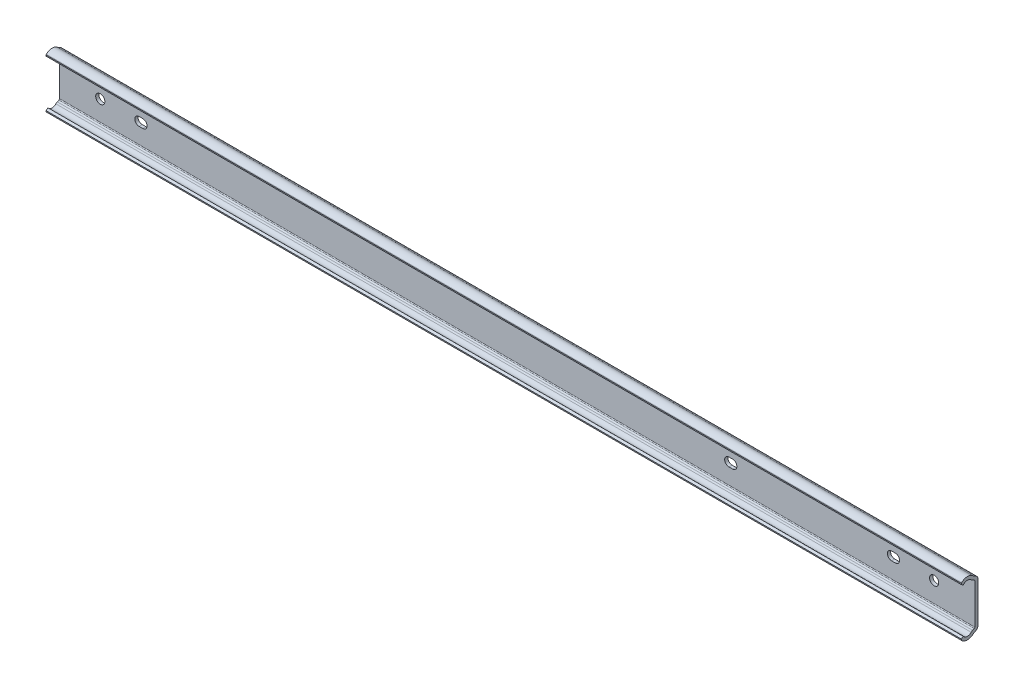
ISO-10303-21;
HEADER;
FILE_DESCRIPTION(('STEP AP214'),'2;1');
FILE_NAME('part.step','',(''),(''),'','','');
FILE_SCHEMA(('AUTOMOTIVE_DESIGN { 1 0 10303 214 1 1 1 1 }'));
ENDSEC;
DATA;
#1=APPLICATION_CONTEXT('core data for automotive mechanical design processes');
#2=APPLICATION_PROTOCOL_DEFINITION('international standard','automotive_design',2000,#1);
#3=PRODUCT_CONTEXT('',#1,'mechanical');
#4=PRODUCT('Part','Part','',(#3));
#5=PRODUCT_RELATED_PRODUCT_CATEGORY('part','',(#4));
#6=PRODUCT_DEFINITION_FORMATION('','',#4);
#7=PRODUCT_DEFINITION_CONTEXT('part definition',#1,'design');
#8=PRODUCT_DEFINITION('design','',#6,#7);
#9=PRODUCT_DEFINITION_SHAPE('','',#8);
#10=(LENGTH_UNIT() NAMED_UNIT(*) SI_UNIT(.MILLI.,.METRE.));
#11=(NAMED_UNIT(*) PLANE_ANGLE_UNIT() SI_UNIT($,.RADIAN.));
#12=(NAMED_UNIT(*) SI_UNIT($,.STERADIAN.) SOLID_ANGLE_UNIT());
#13=UNCERTAINTY_MEASURE_WITH_UNIT(LENGTH_MEASURE(1.E-05),#10,'distance_accuracy_value','');
#14=(GEOMETRIC_REPRESENTATION_CONTEXT(3) GLOBAL_UNCERTAINTY_ASSIGNED_CONTEXT((#13)) GLOBAL_UNIT_ASSIGNED_CONTEXT((#10,
#11,#12)) REPRESENTATION_CONTEXT('',''));
#15=CARTESIAN_POINT('',(0.,0.,0.));
#16=DIRECTION('',(0.,0.,1.));
#17=DIRECTION('',(1.,0.,0.));
#18=AXIS2_PLACEMENT_3D('',#15,#16,#17);
#19=CARTESIAN_POINT('',(-20.,9.85313395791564,1.54999999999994));
#20=DIRECTION('',(0.,0.,1.));
#21=DIRECTION('',(-1.,0.,0.));
#22=AXIS2_PLACEMENT_3D('',#19,#20,#21);
#23=PLANE('',#22);
#24=DIRECTION('',(0.,-1.,0.));
#25=VECTOR('',#24,1.);
#26=CARTESIAN_POINT('',(-20.,9.85313395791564,1.54999999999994));
#27=LINE('',#26,#25);
#28=CARTESIAN_POINT('',(-20.,9.85313395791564,1.54999999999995));
#29=VERTEX_POINT('',#28);
#30=CARTESIAN_POINT('',(-20.,-9.85313395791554,1.54999999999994));
#31=VERTEX_POINT('',#30);
#32=EDGE_CURVE('E510',#29,#31,#27,.T.);
#33=ORIENTED_EDGE('',*,*,#32,.T.);
#34=DIRECTION('',(1.,0.,0.));
#35=VECTOR('',#34,1.);
#36=CARTESIAN_POINT('',(-20.,-9.85313395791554,1.54999999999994));
#37=LINE('',#36,#35);
#38=CARTESIAN_POINT('',(430.,-9.85313395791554,1.54999999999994));
#39=VERTEX_POINT('',#38);
#40=EDGE_CURVE('E524',#31,#39,#37,.T.);
#41=ORIENTED_EDGE('',*,*,#40,.T.);
#42=DIRECTION('',(0.,-1.,0.));
#43=VECTOR('',#42,1.);
#44=CARTESIAN_POINT('',(430.,9.85313395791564,1.54999999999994));
#45=LINE('',#44,#43);
#46=CARTESIAN_POINT('',(430.,9.85313395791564,1.54999999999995));
#47=VERTEX_POINT('',#46);
#48=EDGE_CURVE('E435',#47,#39,#45,.T.);
#49=ORIENTED_EDGE('',*,*,#48,.F.);
#50=DIRECTION('',(1.,0.,0.));
#51=VECTOR('',#50,1.);
#52=CARTESIAN_POINT('',(-20.,9.85313395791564,1.54999999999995));
#53=LINE('',#52,#51);
#54=EDGE_CURVE('E526',#29,#47,#53,.T.);
#55=ORIENTED_EDGE('',*,*,#54,.F.);
#56=EDGE_LOOP('',(#33,#41,#49,#55));
#57=FACE_BOUND('',#56,.T.);
#58=CARTESIAN_POINT('',(20.9,0.,1.54999999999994));
#59=DIRECTION('',(0.,0.,1.));
#60=DIRECTION('',(-1.,0.,0.));
#61=AXIS2_PLACEMENT_3D('',#58,#59,#60);
#62=CIRCLE('',#61,2.1);
#63=CARTESIAN_POINT('',(20.9,-2.1,1.54999999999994));
#64=VERTEX_POINT('',#63);
#65=CARTESIAN_POINT('',(20.9,2.1,1.54999999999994));
#66=VERTEX_POINT('',#65);
#67=EDGE_CURVE('E31',#64,#66,#62,.T.);
#68=ORIENTED_EDGE('',*,*,#67,.F.);
#69=DIRECTION('',(1.,0.,0.));
#70=VECTOR('',#69,1.);
#71=CARTESIAN_POINT('',(20.9,-2.1,1.54999999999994));
#72=LINE('',#71,#70);
#73=CARTESIAN_POINT('',(19.1,-2.1,1.54999999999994));
#74=VERTEX_POINT('',#73);
#75=EDGE_CURVE('E277',#74,#64,#72,.T.);
#76=ORIENTED_EDGE('',*,*,#75,.F.);
#77=CARTESIAN_POINT('',(19.1,0.,1.54999999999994));
#78=DIRECTION('',(0.,0.,1.));
#79=DIRECTION('',(-1.,0.,0.));
#80=AXIS2_PLACEMENT_3D('',#77,#78,#79);
#81=CIRCLE('',#80,2.1);
#82=CARTESIAN_POINT('',(19.1,2.1,1.54999999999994));
#83=VERTEX_POINT('',#82);
#84=EDGE_CURVE('E262',#83,#74,#81,.T.);
#85=ORIENTED_EDGE('',*,*,#84,.F.);
#86=DIRECTION('',(-1.,0.,0.));
#87=VECTOR('',#86,1.);
#88=CARTESIAN_POINT('',(20.9,2.1,1.54999999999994));
#89=LINE('',#88,#87);
#90=EDGE_CURVE('E271',#66,#83,#89,.T.);
#91=ORIENTED_EDGE('',*,*,#90,.F.);
#92=EDGE_LOOP('',(#68,#76,#85,#91));
#93=FACE_BOUND('',#92,.T.);
#94=CARTESIAN_POINT('',(310.9,0.,1.54999999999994));
#95=DIRECTION('',(0.,0.,1.));
#96=DIRECTION('',(-1.,0.,0.));
#97=AXIS2_PLACEMENT_3D('',#94,#95,#96);
#98=CIRCLE('',#97,2.1);
#99=CARTESIAN_POINT('',(310.9,-2.09999999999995,1.54999999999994));
#100=VERTEX_POINT('',#99);
#101=CARTESIAN_POINT('',(310.9,2.10000000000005,1.54999999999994));
#102=VERTEX_POINT('',#101);
#103=EDGE_CURVE('E293',#100,#102,#98,.T.);
#104=ORIENTED_EDGE('',*,*,#103,.F.);
#105=DIRECTION('',(1.,0.,0.));
#106=VECTOR('',#105,1.);
#107=CARTESIAN_POINT('',(310.9,-2.09999999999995,1.54999999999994));
#108=LINE('',#107,#106);
#109=CARTESIAN_POINT('',(309.1,-2.09999999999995,1.54999999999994));
#110=VERTEX_POINT('',#109);
#111=EDGE_CURVE('E303',#110,#100,#108,.T.);
#112=ORIENTED_EDGE('',*,*,#111,.F.);
#113=CARTESIAN_POINT('',(309.1,0.,1.54999999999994));
#114=DIRECTION('',(0.,0.,1.));
#115=DIRECTION('',(-1.,0.,0.));
#116=AXIS2_PLACEMENT_3D('',#113,#114,#115);
#117=CIRCLE('',#116,2.1);
#118=CARTESIAN_POINT('',(309.1,2.10000000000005,1.54999999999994));
#119=VERTEX_POINT('',#118);
#120=EDGE_CURVE('E300',#119,#110,#117,.T.);
#121=ORIENTED_EDGE('',*,*,#120,.F.);
#122=DIRECTION('',(-1.,0.,0.));
#123=VECTOR('',#122,1.);
#124=CARTESIAN_POINT('',(310.9,2.10000000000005,1.54999999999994));
#125=LINE('',#124,#123);
#126=EDGE_CURVE('E297',#102,#119,#125,.T.);
#127=ORIENTED_EDGE('',*,*,#126,.F.);
#128=EDGE_LOOP('',(#104,#112,#121,#127));
#129=FACE_BOUND('',#128,.T.);
#130=CARTESIAN_POINT('',(410.,0.,1.54999999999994));
#131=DIRECTION('',(0.,0.,1.));
#132=DIRECTION('',(-1.,0.,0.));
#133=AXIS2_PLACEMENT_3D('',#130,#131,#132);
#134=CIRCLE('',#133,2.24999999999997);
#135=CARTESIAN_POINT('',(407.75,0.,1.54999999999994));
#136=VERTEX_POINT('',#135);
#137=EDGE_CURVE('E321',#136,#136,#134,.T.);
#138=ORIENTED_EDGE('',*,*,#137,.F.);
#139=EDGE_LOOP('',(#138));
#140=FACE_BOUND('',#139,.T.);
#141=CARTESIAN_POINT('',(0.,0.,1.54999999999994));
#142=DIRECTION('',(0.,0.,1.));
#143=DIRECTION('',(-1.,0.,0.));
#144=AXIS2_PLACEMENT_3D('',#141,#142,#143);
#145=CIRCLE('',#144,2.24999999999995);
#146=CARTESIAN_POINT('',(-2.24999999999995,0.,1.54999999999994));
#147=VERTEX_POINT('',#146);
#148=EDGE_CURVE('E333',#147,#147,#145,.T.);
#149=ORIENTED_EDGE('',*,*,#148,.F.);
#150=EDGE_LOOP('',(#149));
#151=FACE_BOUND('',#150,.T.);
#152=CARTESIAN_POINT('',(389.1,0.,1.54999999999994));
#153=DIRECTION('',(0.,0.,1.));
#154=DIRECTION('',(-1.,0.,0.));
#155=AXIS2_PLACEMENT_3D('',#152,#153,#154);
#156=CIRCLE('',#155,2.1);
#157=CARTESIAN_POINT('',(389.1,2.10000000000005,1.54999999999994));
#158=VERTEX_POINT('',#157);
#159=CARTESIAN_POINT('',(389.1,-2.09999999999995,1.54999999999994));
#160=VERTEX_POINT('',#159);
#161=EDGE_CURVE('E339',#158,#160,#156,.T.);
#162=ORIENTED_EDGE('',*,*,#161,.F.);
#163=DIRECTION('',(-1.,0.,0.));
#164=VECTOR('',#163,1.);
#165=CARTESIAN_POINT('',(390.9,2.10000000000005,1.54999999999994));
#166=LINE('',#165,#164);
#167=CARTESIAN_POINT('',(390.9,2.10000000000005,1.54999999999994));
#168=VERTEX_POINT('',#167);
#169=EDGE_CURVE('E347',#168,#158,#166,.T.);
#170=ORIENTED_EDGE('',*,*,#169,.F.);
#171=CARTESIAN_POINT('',(390.9,0.,1.54999999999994));
#172=DIRECTION('',(0.,0.,1.));
#173=DIRECTION('',(-1.,0.,0.));
#174=AXIS2_PLACEMENT_3D('',#171,#172,#173);
#175=CIRCLE('',#174,2.1);
#176=CARTESIAN_POINT('',(390.9,-2.09999999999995,1.54999999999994));
#177=VERTEX_POINT('',#176);
#178=EDGE_CURVE('E344',#177,#168,#175,.T.);
#179=ORIENTED_EDGE('',*,*,#178,.F.);
#180=DIRECTION('',(1.,0.,0.));
#181=VECTOR('',#180,1.);
#182=CARTESIAN_POINT('',(390.9,-2.09999999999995,1.54999999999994));
#183=LINE('',#182,#181);
#184=EDGE_CURVE('E341',#160,#177,#183,.T.);
#185=ORIENTED_EDGE('',*,*,#184,.F.);
#186=EDGE_LOOP('',(#162,#170,#179,#185));
#187=FACE_BOUND('',#186,.T.);
#188=ADVANCED_FACE('F14',(#57,#93,#129,#140,#151,#187),#23,.T.);
#189=CARTESIAN_POINT('',(-20.,9.85313395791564,0.));
#190=DIRECTION('',(0.,0.,-1.));
#191=DIRECTION('',(1.,0.,0.));
#192=AXIS2_PLACEMENT_3D('',#189,#190,#191);
#193=PLANE('',#192);
#194=DIRECTION('',(0.,1.,0.));
#195=VECTOR('',#194,1.);
#196=CARTESIAN_POINT('',(-20.,9.85313395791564,0.));
#197=LINE('',#196,#195);
#198=CARTESIAN_POINT('',(-20.,-9.85313395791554,0.));
#199=VERTEX_POINT('',#198);
#200=CARTESIAN_POINT('',(-20.,9.85313395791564,0.));
#201=VERTEX_POINT('',#200);
#202=EDGE_CURVE('E473',#199,#201,#197,.T.);
#203=ORIENTED_EDGE('',*,*,#202,.T.);
#204=DIRECTION('',(1.,0.,0.));
#205=VECTOR('',#204,1.);
#206=CARTESIAN_POINT('',(-20.,9.85313395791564,0.));
#207=LINE('',#206,#205);
#208=CARTESIAN_POINT('',(430.,9.85313395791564,0.));
#209=VERTEX_POINT('',#208);
#210=EDGE_CURVE('E551',#201,#209,#207,.T.);
#211=ORIENTED_EDGE('',*,*,#210,.T.);
#212=DIRECTION('',(0.,1.,0.));
#213=VECTOR('',#212,1.);
#214=CARTESIAN_POINT('',(430.,9.85313395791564,0.));
#215=LINE('',#214,#213);
#216=CARTESIAN_POINT('',(430.,-9.85313395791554,0.));
#217=VERTEX_POINT('',#216);
#218=EDGE_CURVE('E397',#217,#209,#215,.T.);
#219=ORIENTED_EDGE('',*,*,#218,.F.);
#220=DIRECTION('',(1.,0.,0.));
#221=VECTOR('',#220,1.);
#222=CARTESIAN_POINT('',(-20.,-9.85313395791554,0.));
#223=LINE('',#222,#221);
#224=EDGE_CURVE('E553',#199,#217,#223,.T.);
#225=ORIENTED_EDGE('',*,*,#224,.F.);
#226=EDGE_LOOP('',(#203,#211,#219,#225));
#227=FACE_BOUND('',#226,.T.);
#228=CARTESIAN_POINT('',(20.9,0.,0.));
#229=DIRECTION('',(0.,0.,1.));
#230=DIRECTION('',(-1.,0.,0.));
#231=AXIS2_PLACEMENT_3D('',#228,#229,#230);
#232=CIRCLE('',#231,2.1);
#233=CARTESIAN_POINT('',(20.9,-2.1,0.));
#234=VERTEX_POINT('',#233);
#235=CARTESIAN_POINT('',(20.9,2.1,0.));
#236=VERTEX_POINT('',#235);
#237=EDGE_CURVE('E279',#234,#236,#232,.T.);
#238=ORIENTED_EDGE('',*,*,#237,.T.);
#239=DIRECTION('',(-1.,0.,0.));
#240=VECTOR('',#239,1.);
#241=CARTESIAN_POINT('',(20.9,2.1,0.));
#242=LINE('',#241,#240);
#243=CARTESIAN_POINT('',(19.1,2.1,0.));
#244=VERTEX_POINT('',#243);
#245=EDGE_CURVE('E285',#236,#244,#242,.T.);
#246=ORIENTED_EDGE('',*,*,#245,.T.);
#247=CARTESIAN_POINT('',(19.1,0.,0.));
#248=DIRECTION('',(0.,0.,1.));
#249=DIRECTION('',(-1.,0.,0.));
#250=AXIS2_PLACEMENT_3D('',#247,#248,#249);
#251=CIRCLE('',#250,2.1);
#252=CARTESIAN_POINT('',(19.1,-2.1,0.));
#253=VERTEX_POINT('',#252);
#254=EDGE_CURVE('E39',#244,#253,#251,.T.);
#255=ORIENTED_EDGE('',*,*,#254,.T.);
#256=DIRECTION('',(1.,0.,0.));
#257=VECTOR('',#256,1.);
#258=CARTESIAN_POINT('',(20.9,-2.1,0.));
#259=LINE('',#258,#257);
#260=EDGE_CURVE('E288',#253,#234,#259,.T.);
#261=ORIENTED_EDGE('',*,*,#260,.T.);
#262=EDGE_LOOP('',(#238,#246,#255,#261));
#263=FACE_BOUND('',#262,.T.);
#264=CARTESIAN_POINT('',(310.9,0.,0.));
#265=DIRECTION('',(0.,0.,1.));
#266=DIRECTION('',(-1.,0.,0.));
#267=AXIS2_PLACEMENT_3D('',#264,#265,#266);
#268=CIRCLE('',#267,2.1);
#269=CARTESIAN_POINT('',(310.9,-2.09999999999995,0.));
#270=VERTEX_POINT('',#269);
#271=CARTESIAN_POINT('',(310.9,2.10000000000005,0.));
#272=VERTEX_POINT('',#271);
#273=EDGE_CURVE('E306',#270,#272,#268,.T.);
#274=ORIENTED_EDGE('',*,*,#273,.T.);
#275=DIRECTION('',(-1.,0.,0.));
#276=VECTOR('',#275,1.);
#277=CARTESIAN_POINT('',(310.9,2.10000000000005,0.));
#278=LINE('',#277,#276);
#279=CARTESIAN_POINT('',(309.1,2.10000000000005,0.));
#280=VERTEX_POINT('',#279);
#281=EDGE_CURVE('E309',#272,#280,#278,.T.);
#282=ORIENTED_EDGE('',*,*,#281,.T.);
#283=CARTESIAN_POINT('',(309.1,0.,0.));
#284=DIRECTION('',(0.,0.,1.));
#285=DIRECTION('',(-1.,0.,0.));
#286=AXIS2_PLACEMENT_3D('',#283,#284,#285);
#287=CIRCLE('',#286,2.1);
#288=CARTESIAN_POINT('',(309.1,-2.09999999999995,0.));
#289=VERTEX_POINT('',#288);
#290=EDGE_CURVE('E312',#280,#289,#287,.T.);
#291=ORIENTED_EDGE('',*,*,#290,.T.);
#292=DIRECTION('',(1.,0.,0.));
#293=VECTOR('',#292,1.);
#294=CARTESIAN_POINT('',(310.9,-2.09999999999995,0.));
#295=LINE('',#294,#293);
#296=EDGE_CURVE('E315',#289,#270,#295,.T.);
#297=ORIENTED_EDGE('',*,*,#296,.T.);
#298=EDGE_LOOP('',(#274,#282,#291,#297));
#299=FACE_BOUND('',#298,.T.);
#300=CARTESIAN_POINT('',(410.,0.,0.));
#301=DIRECTION('',(0.,0.,1.));
#302=DIRECTION('',(-1.,0.,0.));
#303=AXIS2_PLACEMENT_3D('',#300,#301,#302);
#304=CIRCLE('',#303,2.24999999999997);
#305=CARTESIAN_POINT('',(407.75,0.,0.));
#306=VERTEX_POINT('',#305);
#307=EDGE_CURVE('E330',#306,#306,#304,.T.);
#308=ORIENTED_EDGE('',*,*,#307,.T.);
#309=EDGE_LOOP('',(#308));
#310=FACE_BOUND('',#309,.T.);
#311=CARTESIAN_POINT('',(0.,0.,0.));
#312=DIRECTION('',(0.,0.,1.));
#313=DIRECTION('',(-1.,0.,0.));
#314=AXIS2_PLACEMENT_3D('',#311,#312,#313);
#315=CIRCLE('',#314,2.24999999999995);
#316=CARTESIAN_POINT('',(-2.24999999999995,0.,0.));
#317=VERTEX_POINT('',#316);
#318=EDGE_CURVE('E336',#317,#317,#315,.T.);
#319=ORIENTED_EDGE('',*,*,#318,.T.);
#320=EDGE_LOOP('',(#319));
#321=FACE_BOUND('',#320,.T.);
#322=CARTESIAN_POINT('',(389.1,0.,0.));
#323=DIRECTION('',(0.,0.,1.));
#324=DIRECTION('',(-1.,0.,0.));
#325=AXIS2_PLACEMENT_3D('',#322,#323,#324);
#326=CIRCLE('',#325,2.1);
#327=CARTESIAN_POINT('',(389.1,2.10000000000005,0.));
#328=VERTEX_POINT('',#327);
#329=CARTESIAN_POINT('',(389.1,-2.09999999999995,0.));
#330=VERTEX_POINT('',#329);
#331=EDGE_CURVE('E350',#328,#330,#326,.T.);
#332=ORIENTED_EDGE('',*,*,#331,.T.);
#333=DIRECTION('',(1.,0.,0.));
#334=VECTOR('',#333,1.);
#335=CARTESIAN_POINT('',(390.9,-2.09999999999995,0.));
#336=LINE('',#335,#334);
#337=CARTESIAN_POINT('',(390.9,-2.09999999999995,0.));
#338=VERTEX_POINT('',#337);
#339=EDGE_CURVE('E353',#330,#338,#336,.T.);
#340=ORIENTED_EDGE('',*,*,#339,.T.);
#341=CARTESIAN_POINT('',(390.9,0.,0.));
#342=DIRECTION('',(0.,0.,1.));
#343=DIRECTION('',(-1.,0.,0.));
#344=AXIS2_PLACEMENT_3D('',#341,#342,#343);
#345=CIRCLE('',#344,2.1);
#346=CARTESIAN_POINT('',(390.9,2.10000000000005,0.));
#347=VERTEX_POINT('',#346);
#348=EDGE_CURVE('E356',#338,#347,#345,.T.);
#349=ORIENTED_EDGE('',*,*,#348,.T.);
#350=DIRECTION('',(-1.,0.,0.));
#351=VECTOR('',#350,1.);
#352=CARTESIAN_POINT('',(390.9,2.10000000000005,0.));
#353=LINE('',#352,#351);
#354=EDGE_CURVE('E359',#347,#328,#353,.T.);
#355=ORIENTED_EDGE('',*,*,#354,.T.);
#356=EDGE_LOOP('',(#332,#340,#349,#355));
#357=FACE_BOUND('',#356,.T.);
#358=ADVANCED_FACE('F618',(#227,#263,#299,#310,#321,#357),#193,.T.);
#359=CARTESIAN_POINT('',(-20.,-9.46999976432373,5.19000022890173));
#360=DIRECTION('',(1.,0.,0.));
#361=DIRECTION('',(0.,0.,1.));
#362=AXIS2_PLACEMENT_3D('',#359,#360,#361);
#363=CYLINDRICAL_SURFACE('',#362,2.47999999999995);
#364=CARTESIAN_POINT('',(430.,-9.46999976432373,5.19000022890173));
#365=DIRECTION('',(-1.,0.,0.));
#366=DIRECTION('',(0.,0.,1.));
#367=AXIS2_PLACEMENT_3D('',#364,#365,#366);
#368=CIRCLE('',#367,2.47999999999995);
#369=CARTESIAN_POINT('',(430.,-11.1527317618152,3.3682392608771));
#370=VERTEX_POINT('',#369);
#371=CARTESIAN_POINT('',(430.,-11.2236245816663,6.94362504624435));
#372=VERTEX_POINT('',#371);
#373=EDGE_CURVE('E365',#370,#372,#368,.T.);
#374=ORIENTED_EDGE('',*,*,#373,.F.);
#375=DIRECTION('',(1.,0.,0.));
#376=VECTOR('',#375,1.);
#377=CARTESIAN_POINT('',(-20.,-11.1527317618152,3.3682392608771));
#378=LINE('',#377,#376);
#379=CARTESIAN_POINT('',(-20.,-11.1527317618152,3.3682392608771));
#380=VERTEX_POINT('',#379);
#381=EDGE_CURVE('E9',#380,#370,#378,.T.);
#382=ORIENTED_EDGE('',*,*,#381,.F.);
#383=CARTESIAN_POINT('',(-20.,-9.46999976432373,5.19000022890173));
#384=DIRECTION('',(-1.,0.,0.));
#385=DIRECTION('',(0.,0.,1.));
#386=AXIS2_PLACEMENT_3D('',#383,#384,#385);
#387=CIRCLE('',#386,2.47999999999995);
#388=CARTESIAN_POINT('',(-20.,-11.2236245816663,6.94362504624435));
#389=VERTEX_POINT('',#388);
#390=EDGE_CURVE('E447',#380,#389,#387,.T.);
#391=ORIENTED_EDGE('',*,*,#390,.T.);
#392=DIRECTION('',(1.,0.,0.));
#393=VECTOR('',#392,1.);
#394=CARTESIAN_POINT('',(-20.,-11.2236245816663,6.94362504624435));
#395=LINE('',#394,#393);
#396=EDGE_CURVE('E18',#389,#372,#395,.T.);
#397=ORIENTED_EDGE('',*,*,#396,.T.);
#398=EDGE_LOOP('',(#374,#382,#391,#397));
#399=FACE_BOUND('',#398,.T.);
#400=ADVANCED_FACE('F16',(#399),#363,.F.);
#401=CARTESIAN_POINT('',(-20.,-12.5436997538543,1.86234824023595));
#402=DIRECTION('',(1.,0.,0.));
#403=DIRECTION('',(0.,0.,1.));
#404=AXIS2_PLACEMENT_3D('',#401,#402,#403);
#405=CYLINDRICAL_SURFACE('',#404,2.04999993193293);
#406=CARTESIAN_POINT('',(430.,-12.5436997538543,1.86234824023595));
#407=DIRECTION('',(1.,0.,0.));
#408=DIRECTION('',(0.,0.,1.));
#409=AXIS2_PLACEMENT_3D('',#406,#407,#408);
#410=CIRCLE('',#409,2.04999993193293);
#411=CARTESIAN_POINT('',(430.,-10.6566648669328,2.66334702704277));
#412=VERTEX_POINT('',#411);
#413=EDGE_CURVE('E444',#412,#370,#410,.T.);
#414=ORIENTED_EDGE('',*,*,#413,.F.);
#415=DIRECTION('',(1.,0.,0.));
#416=VECTOR('',#415,1.);
#417=CARTESIAN_POINT('',(-20.,-10.6566648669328,2.66334702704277));
#418=LINE('',#417,#416);
#419=CARTESIAN_POINT('',(-20.,-10.6566648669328,2.66334702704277));
#420=VERTEX_POINT('',#419);
#421=EDGE_CURVE('E23',#420,#412,#418,.T.);
#422=ORIENTED_EDGE('',*,*,#421,.F.);
#423=CARTESIAN_POINT('',(-20.,-12.5436997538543,1.86234824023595));
#424=DIRECTION('',(1.,0.,0.));
#425=DIRECTION('',(0.,0.,1.));
#426=AXIS2_PLACEMENT_3D('',#423,#424,#425);
#427=CIRCLE('',#426,2.04999993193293);
#428=EDGE_CURVE('E518',#420,#380,#427,.T.);
#429=ORIENTED_EDGE('',*,*,#428,.T.);
#430=ORIENTED_EDGE('',*,*,#381,.T.);
#431=EDGE_LOOP('',(#414,#422,#429,#430));
#432=FACE_BOUND('',#431,.T.);
#433=ADVANCED_FACE('F581',(#432),#405,.T.);
#434=CARTESIAN_POINT('',(-20.,-10.6566648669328,2.66334702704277));
#435=DIRECTION('',(0.,0.920504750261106,0.390731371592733));
#436=DIRECTION('',(0.,-0.390731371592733,0.920504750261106));
#437=AXIS2_PLACEMENT_3D('',#434,#435,#436);
#438=PLANE('',#437);
#439=DIRECTION('',(0.,-0.390731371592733,0.920504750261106));
#440=VECTOR('',#439,1.);
#441=CARTESIAN_POINT('',(430.,-10.6566648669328,2.66334702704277));
#442=LINE('',#441,#440);
#443=CARTESIAN_POINT('',(430.,-10.3133868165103,1.85463521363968));
#444=VERTEX_POINT('',#443);
#445=EDGE_CURVE('E441',#444,#412,#442,.T.);
#446=ORIENTED_EDGE('',*,*,#445,.F.);
#447=DIRECTION('',(1.,0.,0.));
#448=VECTOR('',#447,1.);
#449=CARTESIAN_POINT('',(-20.,-10.3133868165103,1.85463521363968));
#450=LINE('',#449,#448);
#451=CARTESIAN_POINT('',(-20.,-10.3133868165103,1.85463521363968));
#452=VERTEX_POINT('',#451);
#453=EDGE_CURVE('E522',#452,#444,#450,.T.);
#454=ORIENTED_EDGE('',*,*,#453,.F.);
#455=DIRECTION('',(0.,-0.390731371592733,0.920504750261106));
#456=VECTOR('',#455,1.);
#457=CARTESIAN_POINT('',(-20.,-10.6566648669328,2.66334702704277));
#458=LINE('',#457,#456);
#459=EDGE_CURVE('E515',#452,#420,#458,.T.);
#460=ORIENTED_EDGE('',*,*,#459,.T.);
#461=ORIENTED_EDGE('',*,*,#421,.T.);
#462=EDGE_LOOP('',(#446,#454,#460,#461));
#463=FACE_BOUND('',#462,.T.);
#464=ADVANCED_FACE('F678',(#463),#438,.T.);
#465=CARTESIAN_POINT('',(-20.,-9.85313395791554,2.05000015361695));
#466=DIRECTION('',(1.,0.,0.));
#467=DIRECTION('',(0.,0.,1.));
#468=AXIS2_PLACEMENT_3D('',#465,#466,#467);
#469=CYLINDRICAL_SURFACE('',#468,0.500000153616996);
#470=CARTESIAN_POINT('',(430.,-9.85313395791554,2.05000015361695));
#471=DIRECTION('',(-1.,0.,0.));
#472=DIRECTION('',(0.,0.,1.));
#473=AXIS2_PLACEMENT_3D('',#470,#471,#472);
#474=CIRCLE('',#473,0.500000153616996);
#475=EDGE_CURVE('E438',#39,#444,#474,.T.);
#476=ORIENTED_EDGE('',*,*,#475,.F.);
#477=ORIENTED_EDGE('',*,*,#40,.F.);
#478=CARTESIAN_POINT('',(-20.,-9.85313395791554,2.05000015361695));
#479=DIRECTION('',(-1.,0.,0.));
#480=DIRECTION('',(0.,0.,1.));
#481=AXIS2_PLACEMENT_3D('',#478,#479,#480);
#482=CIRCLE('',#481,0.500000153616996);
#483=EDGE_CURVE('E512',#31,#452,#482,.T.);
#484=ORIENTED_EDGE('',*,*,#483,.T.);
#485=ORIENTED_EDGE('',*,*,#453,.T.);
#486=EDGE_LOOP('',(#476,#477,#484,#485));
#487=FACE_BOUND('',#486,.T.);
#488=ADVANCED_FACE('F676',(#487),#469,.F.);
#489=CARTESIAN_POINT('',(-20.,9.85313395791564,2.05000015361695));
#490=DIRECTION('',(1.,0.,0.));
#491=DIRECTION('',(0.,0.,1.));
#492=AXIS2_PLACEMENT_3D('',#489,#490,#491);
#493=CYLINDRICAL_SURFACE('',#492,0.500000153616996);
#494=CARTESIAN_POINT('',(430.,9.85313395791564,2.05000015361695));
#495=DIRECTION('',(-1.,0.,0.));
#496=DIRECTION('',(0.,0.,-1.));
#497=AXIS2_PLACEMENT_3D('',#494,#495,#496);
#498=CIRCLE('',#497,0.500000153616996);
#499=CARTESIAN_POINT('',(430.,10.3133868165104,1.85463521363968));
#500=VERTEX_POINT('',#499);
#501=EDGE_CURVE('E432',#500,#47,#498,.T.);
#502=ORIENTED_EDGE('',*,*,#501,.F.);
#503=DIRECTION('',(1.,0.,0.));
#504=VECTOR('',#503,1.);
#505=CARTESIAN_POINT('',(-20.,10.3133868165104,1.85463521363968));
#506=LINE('',#505,#504);
#507=CARTESIAN_POINT('',(-20.,10.3133868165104,1.85463521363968));
#508=VERTEX_POINT('',#507);
#509=EDGE_CURVE('E528',#508,#500,#506,.T.);
#510=ORIENTED_EDGE('',*,*,#509,.F.);
#511=CARTESIAN_POINT('',(-20.,9.85313395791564,2.05000015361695));
#512=DIRECTION('',(-1.,0.,0.));
#513=DIRECTION('',(0.,0.,-1.));
#514=AXIS2_PLACEMENT_3D('',#511,#512,#513);
#515=CIRCLE('',#514,0.500000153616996);
#516=EDGE_CURVE('E507',#508,#29,#515,.T.);
#517=ORIENTED_EDGE('',*,*,#516,.T.);
#518=ORIENTED_EDGE('',*,*,#54,.T.);
#519=EDGE_LOOP('',(#502,#510,#517,#518));
#520=FACE_BOUND('',#519,.T.);
#521=ADVANCED_FACE('F668',(#520),#493,.F.);
#522=CARTESIAN_POINT('',(-20.,10.6566648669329,2.66334702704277));
#523=DIRECTION('',(0.,-0.920504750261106,0.390731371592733));
#524=DIRECTION('',(0.,-0.390731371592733,-0.920504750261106));
#525=AXIS2_PLACEMENT_3D('',#522,#523,#524);
#526=PLANE('',#525);
#527=DIRECTION('',(0.,-0.390731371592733,-0.920504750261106));
#528=VECTOR('',#527,1.);
#529=CARTESIAN_POINT('',(430.,10.6566648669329,2.66334702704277));
#530=LINE('',#529,#528);
#531=CARTESIAN_POINT('',(430.,10.6566648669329,2.66334702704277));
#532=VERTEX_POINT('',#531);
#533=EDGE_CURVE('E429',#532,#500,#530,.T.);
#534=ORIENTED_EDGE('',*,*,#533,.F.);
#535=DIRECTION('',(1.,0.,0.));
#536=VECTOR('',#535,1.);
#537=CARTESIAN_POINT('',(-20.,10.6566648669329,2.66334702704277));
#538=LINE('',#537,#536);
#539=CARTESIAN_POINT('',(-20.,10.6566648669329,2.66334702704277));
#540=VERTEX_POINT('',#539);
#541=EDGE_CURVE('E530',#540,#532,#538,.T.);
#542=ORIENTED_EDGE('',*,*,#541,.F.);
#543=DIRECTION('',(0.,-0.390731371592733,-0.920504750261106));
#544=VECTOR('',#543,1.);
#545=CARTESIAN_POINT('',(-20.,10.6566648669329,2.66334702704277));
#546=LINE('',#545,#544);
#547=EDGE_CURVE('E504',#540,#508,#546,.T.);
#548=ORIENTED_EDGE('',*,*,#547,.T.);
#549=ORIENTED_EDGE('',*,*,#509,.T.);
#550=EDGE_LOOP('',(#534,#542,#548,#549));
#551=FACE_BOUND('',#550,.T.);
#552=ADVANCED_FACE('F664',(#551),#526,.T.);
#553=CARTESIAN_POINT('',(-20.,12.5436997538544,1.86234824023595));
#554=DIRECTION('',(1.,0.,0.));
#555=DIRECTION('',(0.,0.,1.));
#556=AXIS2_PLACEMENT_3D('',#553,#554,#555);
#557=CYLINDRICAL_SURFACE('',#556,2.04999993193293);
#558=CARTESIAN_POINT('',(430.,12.5436997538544,1.86234824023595));
#559=DIRECTION('',(1.,0.,0.));
#560=DIRECTION('',(0.,0.,-1.));
#561=AXIS2_PLACEMENT_3D('',#558,#559,#560);
#562=CIRCLE('',#561,2.04999993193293);
#563=CARTESIAN_POINT('',(430.,11.1527317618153,3.36823926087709));
#564=VERTEX_POINT('',#563);
#565=EDGE_CURVE('E426',#564,#532,#562,.T.);
#566=ORIENTED_EDGE('',*,*,#565,.F.);
#567=DIRECTION('',(1.,0.,0.));
#568=VECTOR('',#567,1.);
#569=CARTESIAN_POINT('',(-20.,11.1527317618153,3.36823926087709));
#570=LINE('',#569,#568);
#571=CARTESIAN_POINT('',(-20.,11.1527317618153,3.36823926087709));
#572=VERTEX_POINT('',#571);
#573=EDGE_CURVE('E532',#572,#564,#570,.T.);
#574=ORIENTED_EDGE('',*,*,#573,.F.);
#575=CARTESIAN_POINT('',(-20.,12.5436997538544,1.86234824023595));
#576=DIRECTION('',(1.,0.,0.));
#577=DIRECTION('',(0.,0.,-1.));
#578=AXIS2_PLACEMENT_3D('',#575,#576,#577);
#579=CIRCLE('',#578,2.04999993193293);
#580=EDGE_CURVE('E501',#572,#540,#579,.T.);
#581=ORIENTED_EDGE('',*,*,#580,.T.);
#582=ORIENTED_EDGE('',*,*,#541,.T.);
#583=EDGE_LOOP('',(#566,#574,#581,#582));
#584=FACE_BOUND('',#583,.T.);
#585=ADVANCED_FACE('F660',(#584),#557,.T.);
#586=CARTESIAN_POINT('',(-20.,9.46999976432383,5.19000022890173));
#587=DIRECTION('',(1.,0.,0.));
#588=DIRECTION('',(0.,0.,1.));
#589=AXIS2_PLACEMENT_3D('',#586,#587,#588);
#590=CYLINDRICAL_SURFACE('',#589,2.47999999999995);
#591=CARTESIAN_POINT('',(430.,9.46999976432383,5.19000022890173));
#592=DIRECTION('',(-1.,0.,0.));
#593=DIRECTION('',(0.,0.,-1.));
#594=AXIS2_PLACEMENT_3D('',#591,#592,#593);
#595=CIRCLE('',#594,2.47999999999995);
#596=CARTESIAN_POINT('',(430.,11.2236245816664,6.94362504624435));
#597=VERTEX_POINT('',#596);
#598=EDGE_CURVE('E423',#597,#564,#595,.T.);
#599=ORIENTED_EDGE('',*,*,#598,.F.);
#600=DIRECTION('',(1.,0.,0.));
#601=VECTOR('',#600,1.);
#602=CARTESIAN_POINT('',(-20.,11.2236245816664,6.94362504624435));
#603=LINE('',#602,#601);
#604=CARTESIAN_POINT('',(-20.,11.2236245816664,6.94362504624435));
#605=VERTEX_POINT('',#604);
#606=EDGE_CURVE('E534',#605,#597,#603,.T.);
#607=ORIENTED_EDGE('',*,*,#606,.F.);
#608=CARTESIAN_POINT('',(-20.,9.46999976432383,5.19000022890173));
#609=DIRECTION('',(-1.,0.,0.));
#610=DIRECTION('',(0.,0.,-1.));
#611=AXIS2_PLACEMENT_3D('',#608,#609,#610);
#612=CIRCLE('',#611,2.47999999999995);
#613=EDGE_CURVE('E498',#605,#572,#612,.T.);
#614=ORIENTED_EDGE('',*,*,#613,.T.);
#615=ORIENTED_EDGE('',*,*,#573,.T.);
#616=EDGE_LOOP('',(#599,#607,#614,#615));
#617=FACE_BOUND('',#616,.T.);
#618=ADVANCED_FACE('F656',(#617),#590,.F.);
#619=CARTESIAN_POINT('',(-20.,11.2236245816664,6.94362504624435));
#620=DIRECTION('',(0.,-0.707107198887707,-0.707106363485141));
#621=DIRECTION('',(0.,0.707106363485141,-0.707107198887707));
#622=AXIS2_PLACEMENT_3D('',#619,#620,#621);
#623=PLANE('',#622);
#624=DIRECTION('',(0.,0.707106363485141,-0.707107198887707));
#625=VECTOR('',#624,1.);
#626=CARTESIAN_POINT('',(430.,11.2236245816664,6.94362504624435));
#627=LINE('',#626,#625);
#628=CARTESIAN_POINT('',(430.,10.9144127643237,7.25283722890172));
#629=VERTEX_POINT('',#628);
#630=EDGE_CURVE('E420',#629,#597,#627,.T.);
#631=ORIENTED_EDGE('',*,*,#630,.F.);
#632=DIRECTION('',(1.,0.,0.));
#633=VECTOR('',#632,1.);
#634=CARTESIAN_POINT('',(-20.,10.9144127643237,7.25283722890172));
#635=LINE('',#634,#633);
#636=CARTESIAN_POINT('',(-20.,10.9144127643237,7.25283722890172));
#637=VERTEX_POINT('',#636);
#638=EDGE_CURVE('E536',#637,#629,#635,.T.);
#639=ORIENTED_EDGE('',*,*,#638,.F.);
#640=DIRECTION('',(0.,0.707106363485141,-0.707107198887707));
#641=VECTOR('',#640,1.);
#642=CARTESIAN_POINT('',(-20.,11.2236245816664,6.94362504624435));
#643=LINE('',#642,#641);
#644=EDGE_CURVE('E495',#637,#605,#643,.T.);
#645=ORIENTED_EDGE('',*,*,#644,.T.);
#646=ORIENTED_EDGE('',*,*,#606,.T.);
#647=EDGE_LOOP('',(#631,#639,#645,#646));
#648=FACE_BOUND('',#647,.T.);
#649=ADVANCED_FACE('F652',(#648),#623,.T.);
#650=CARTESIAN_POINT('',(-20.,10.9144127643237,7.25283722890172));
#651=DIRECTION('',(0.,-0.819151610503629,0.573577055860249));
#652=DIRECTION('',(0.,-0.573577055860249,-0.819151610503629));
#653=AXIS2_PLACEMENT_3D('',#650,#651,#652);
#654=PLANE('',#653);
#655=DIRECTION('',(0.,-0.573577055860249,-0.819151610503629));
#656=VECTOR('',#655,1.);
#657=CARTESIAN_POINT('',(430.,10.9144127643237,7.25283722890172));
#658=LINE('',#657,#656);
#659=CARTESIAN_POINT('',(430.,11.5986307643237,8.23000022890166));
#660=VERTEX_POINT('',#659);
#661=EDGE_CURVE('E417',#660,#629,#658,.T.);
#662=ORIENTED_EDGE('',*,*,#661,.F.);
#663=DIRECTION('',(1.,0.,0.));
#664=VECTOR('',#663,1.);
#665=CARTESIAN_POINT('',(-20.,11.5986307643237,8.23000022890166));
#666=LINE('',#665,#664);
#667=CARTESIAN_POINT('',(-20.,11.5986307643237,8.23000022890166));
#668=VERTEX_POINT('',#667);
#669=EDGE_CURVE('E538',#668,#660,#666,.T.);
#670=ORIENTED_EDGE('',*,*,#669,.F.);
#671=DIRECTION('',(0.,-0.573577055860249,-0.819151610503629));
#672=VECTOR('',#671,1.);
#673=CARTESIAN_POINT('',(-20.,10.9144127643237,7.25283722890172));
#674=LINE('',#673,#672);
#675=EDGE_CURVE('E492',#668,#637,#674,.T.);
#676=ORIENTED_EDGE('',*,*,#675,.T.);
#677=ORIENTED_EDGE('',*,*,#638,.T.);
#678=EDGE_LOOP('',(#662,#670,#676,#677));
#679=FACE_BOUND('',#678,.T.);
#680=ADVANCED_FACE('F648',(#679),#654,.T.);
#681=CARTESIAN_POINT('',(-20.,12.1292794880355,8.22999995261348));
#682=DIRECTION('',(0.,5.20661172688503E-07,0.999999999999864));
#683=DIRECTION('',(0.,-0.999999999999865,5.20661172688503E-07));
#684=AXIS2_PLACEMENT_3D('',#681,#682,#683);
#685=PLANE('',#684);
#686=DIRECTION('',(0.,-0.999999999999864,5.20661172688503E-07));
#687=VECTOR('',#686,1.);
#688=CARTESIAN_POINT('',(430.,12.1292794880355,8.22999995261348));
#689=LINE('',#688,#687);
#690=CARTESIAN_POINT('',(430.,12.1292794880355,8.22999995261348));
#691=VERTEX_POINT('',#690);
#692=EDGE_CURVE('E414',#691,#660,#689,.T.);
#693=ORIENTED_EDGE('',*,*,#692,.F.);
#694=DIRECTION('',(1.,0.,0.));
#695=VECTOR('',#694,1.);
#696=CARTESIAN_POINT('',(-20.,12.1292794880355,8.22999995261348));
#697=LINE('',#696,#695);
#698=CARTESIAN_POINT('',(-20.,12.1292794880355,8.22999995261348));
#699=VERTEX_POINT('',#698);
#700=EDGE_CURVE('E540',#699,#691,#697,.T.);
#701=ORIENTED_EDGE('',*,*,#700,.F.);
#702=DIRECTION('',(0.,-0.999999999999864,5.20661172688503E-07));
#703=VECTOR('',#702,1.);
#704=CARTESIAN_POINT('',(-20.,12.1292794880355,8.22999995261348));
#705=LINE('',#704,#703);
#706=EDGE_CURVE('E489',#699,#668,#705,.T.);
#707=ORIENTED_EDGE('',*,*,#706,.T.);
#708=ORIENTED_EDGE('',*,*,#669,.T.);
#709=EDGE_LOOP('',(#693,#701,#707,#708));
#710=FACE_BOUND('',#709,.T.);
#711=ADVANCED_FACE('F644',(#710),#685,.T.);
#712=CARTESIAN_POINT('',(-20.,12.3196398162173,8.03964028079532));
#713=DIRECTION('',(0.,0.70710556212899,0.707108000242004));
#714=DIRECTION('',(0.,-0.707108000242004,0.70710556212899));
#715=AXIS2_PLACEMENT_3D('',#712,#713,#714);
#716=PLANE('',#715);
#717=DIRECTION('',(0.,-0.707108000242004,0.70710556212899));
#718=VECTOR('',#717,1.);
#719=CARTESIAN_POINT('',(430.,12.3196398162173,8.03964028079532));
#720=LINE('',#719,#718);
#721=CARTESIAN_POINT('',(430.,12.3196398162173,8.03964028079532));
#722=VERTEX_POINT('',#721);
#723=EDGE_CURVE('E411',#722,#691,#720,.T.);
#724=ORIENTED_EDGE('',*,*,#723,.F.);
#725=DIRECTION('',(1.,0.,0.));
#726=VECTOR('',#725,1.);
#727=CARTESIAN_POINT('',(-20.,12.3196398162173,8.03964028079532));
#728=LINE('',#727,#726);
#729=CARTESIAN_POINT('',(-20.,12.3196398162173,8.03964028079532));
#730=VERTEX_POINT('',#729);
#731=EDGE_CURVE('E542',#730,#722,#728,.T.);
#732=ORIENTED_EDGE('',*,*,#731,.F.);
#733=DIRECTION('',(0.,-0.707108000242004,0.70710556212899));
#734=VECTOR('',#733,1.);
#735=CARTESIAN_POINT('',(-20.,12.3196398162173,8.03964028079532));
#736=LINE('',#735,#734);
#737=EDGE_CURVE('E486',#730,#699,#736,.T.);
#738=ORIENTED_EDGE('',*,*,#737,.T.);
#739=ORIENTED_EDGE('',*,*,#700,.T.);
#740=EDGE_LOOP('',(#724,#732,#738,#739));
#741=FACE_BOUND('',#740,.T.);
#742=ADVANCED_FACE('F640',(#741),#716,.T.);
#743=CARTESIAN_POINT('',(-20.,9.46999976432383,5.19000022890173));
#744=DIRECTION('',(1.,0.,0.));
#745=DIRECTION('',(0.,0.,1.));
#746=AXIS2_PLACEMENT_3D('',#743,#744,#745);
#747=CYLINDRICAL_SURFACE('',#746,4.02999960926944);
#748=CARTESIAN_POINT('',(430.,9.46999976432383,5.19000022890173));
#749=DIRECTION('',(1.,0.,0.));
#750=DIRECTION('',(0.,0.,-1.));
#751=AXIS2_PLACEMENT_3D('',#748,#749,#750);
#752=CIRCLE('',#751,4.02999960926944);
#753=CARTESIAN_POINT('',(430.,12.2044389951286,2.22963894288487));
#754=VERTEX_POINT('',#753);
#755=EDGE_CURVE('E408',#754,#722,#752,.T.);
#756=ORIENTED_EDGE('',*,*,#755,.F.);
#757=DIRECTION('',(1.,0.,0.));
#758=VECTOR('',#757,1.);
#759=CARTESIAN_POINT('',(-20.,12.2044389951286,2.22963894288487));
#760=LINE('',#759,#758);
#761=CARTESIAN_POINT('',(-20.,12.2044389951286,2.22963894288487));
#762=VERTEX_POINT('',#761);
#763=EDGE_CURVE('E544',#762,#754,#760,.T.);
#764=ORIENTED_EDGE('',*,*,#763,.F.);
#765=CARTESIAN_POINT('',(-20.,9.46999976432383,5.19000022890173));
#766=DIRECTION('',(1.,0.,0.));
#767=DIRECTION('',(0.,0.,-1.));
#768=AXIS2_PLACEMENT_3D('',#765,#766,#767);
#769=CIRCLE('',#768,4.02999960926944);
#770=EDGE_CURVE('E483',#762,#730,#769,.T.);
#771=ORIENTED_EDGE('',*,*,#770,.T.);
#772=ORIENTED_EDGE('',*,*,#731,.T.);
#773=EDGE_LOOP('',(#756,#764,#771,#772));
#774=FACE_BOUND('',#773,.T.);
#775=ADVANCED_FACE('F636',(#774),#747,.T.);
#776=CARTESIAN_POINT('',(-20.,12.5436997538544,1.86234824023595));
#777=DIRECTION('',(1.,0.,0.));
#778=DIRECTION('',(0.,0.,1.));
#779=AXIS2_PLACEMENT_3D('',#776,#777,#778);
#780=CYLINDRICAL_SURFACE('',#779,0.500000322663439);
#781=CARTESIAN_POINT('',(430.,12.5436997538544,1.86234824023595));
#782=DIRECTION('',(-1.,0.,0.));
#783=DIRECTION('',(0.,0.,-1.));
#784=AXIS2_PLACEMENT_3D('',#781,#782,#783);
#785=CIRCLE('',#784,0.500000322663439);
#786=CARTESIAN_POINT('',(430.,12.0834470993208,2.05771409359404));
#787=VERTEX_POINT('',#786);
#788=EDGE_CURVE('E405',#787,#754,#785,.T.);
#789=ORIENTED_EDGE('',*,*,#788,.F.);
#790=DIRECTION('',(1.,0.,0.));
#791=VECTOR('',#790,1.);
#792=CARTESIAN_POINT('',(-20.,12.0834470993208,2.05771409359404));
#793=LINE('',#792,#791);
#794=CARTESIAN_POINT('',(-20.,12.0834470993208,2.05771409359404));
#795=VERTEX_POINT('',#794);
#796=EDGE_CURVE('E546',#795,#787,#793,.T.);
#797=ORIENTED_EDGE('',*,*,#796,.F.);
#798=CARTESIAN_POINT('',(-20.,12.5436997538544,1.86234824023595));
#799=DIRECTION('',(-1.,0.,0.));
#800=DIRECTION('',(0.,0.,-1.));
#801=AXIS2_PLACEMENT_3D('',#798,#799,#800);
#802=CIRCLE('',#801,0.500000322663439);
#803=EDGE_CURVE('E480',#795,#762,#802,.T.);
#804=ORIENTED_EDGE('',*,*,#803,.T.);
#805=ORIENTED_EDGE('',*,*,#763,.T.);
#806=EDGE_LOOP('',(#789,#797,#804,#805));
#807=FACE_BOUND('',#806,.T.);
#808=ADVANCED_FACE('F633',(#807),#780,.F.);
#809=CARTESIAN_POINT('',(-20.,12.0834470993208,2.05771409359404));
#810=DIRECTION('',(0.,0.920504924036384,-0.390730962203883));
#811=DIRECTION('',(0.,0.390730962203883,0.920504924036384));
#812=AXIS2_PLACEMENT_3D('',#809,#810,#811);
#813=PLANE('',#812);
#814=DIRECTION('',(0.,0.390730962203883,0.920504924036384));
#815=VECTOR('',#814,1.);
#816=CARTESIAN_POINT('',(430.,12.0834470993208,2.05771409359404));
#817=LINE('',#816,#815);
#818=CARTESIAN_POINT('',(430.,11.7401690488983,1.24900128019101));
#819=VERTEX_POINT('',#818);
#820=EDGE_CURVE('E403',#819,#787,#817,.T.);
#821=ORIENTED_EDGE('',*,*,#820,.F.);
#822=DIRECTION('',(1.,0.,0.));
#823=VECTOR('',#822,1.);
#824=CARTESIAN_POINT('',(-20.,11.7401690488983,1.24900128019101));
#825=LINE('',#824,#823);
#826=CARTESIAN_POINT('',(-20.,11.7401690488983,1.24900128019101));
#827=VERTEX_POINT('',#826);
#828=EDGE_CURVE('E549',#827,#819,#825,.T.);
#829=ORIENTED_EDGE('',*,*,#828,.F.);
#830=DIRECTION('',(0.,0.390730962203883,0.920504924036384));
#831=VECTOR('',#830,1.);
#832=CARTESIAN_POINT('',(-20.,12.0834470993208,2.05771409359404));
#833=LINE('',#832,#831);
#834=EDGE_CURVE('E478',#827,#795,#833,.T.);
#835=ORIENTED_EDGE('',*,*,#834,.T.);
#836=ORIENTED_EDGE('',*,*,#796,.T.);
#837=EDGE_LOOP('',(#821,#829,#835,#836));
#838=FACE_BOUND('',#837,.T.);
#839=ADVANCED_FACE('F628',(#838),#813,.T.);
#840=CARTESIAN_POINT('',(-20.,9.85313395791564,2.05000015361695));
#841=DIRECTION('',(1.,0.,0.));
#842=DIRECTION('',(0.,0.,1.));
#843=AXIS2_PLACEMENT_3D('',#840,#841,#842);
#844=CYLINDRICAL_SURFACE('',#843,2.05000015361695);
#845=CARTESIAN_POINT('',(430.,9.85313395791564,2.05000015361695));
#846=DIRECTION('',(1.,0.,0.));
#847=DIRECTION('',(0.,0.,-1.));
#848=AXIS2_PLACEMENT_3D('',#845,#846,#847);
#849=CIRCLE('',#848,2.05000015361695);
#850=EDGE_CURVE('E400',#209,#819,#849,.T.);
#851=ORIENTED_EDGE('',*,*,#850,.F.);
#852=ORIENTED_EDGE('',*,*,#210,.F.);
#853=CARTESIAN_POINT('',(-20.,9.85313395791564,2.05000015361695));
#854=DIRECTION('',(1.,0.,0.));
#855=DIRECTION('',(0.,0.,-1.));
#856=AXIS2_PLACEMENT_3D('',#853,#854,#855);
#857=CIRCLE('',#856,2.05000015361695);
#858=EDGE_CURVE('E475',#201,#827,#857,.T.);
#859=ORIENTED_EDGE('',*,*,#858,.T.);
#860=ORIENTED_EDGE('',*,*,#828,.T.);
#861=EDGE_LOOP('',(#851,#852,#859,#860));
#862=FACE_BOUND('',#861,.T.);
#863=ADVANCED_FACE('F624',(#862),#844,.T.);
#864=CARTESIAN_POINT('',(-20.,-9.85313395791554,2.05000015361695));
#865=DIRECTION('',(1.,0.,0.));
#866=DIRECTION('',(0.,0.,1.));
#867=AXIS2_PLACEMENT_3D('',#864,#865,#866);
#868=CYLINDRICAL_SURFACE('',#867,2.05000015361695);
#869=CARTESIAN_POINT('',(430.,-9.85313395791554,2.05000015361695));
#870=DIRECTION('',(1.,0.,0.));
#871=DIRECTION('',(0.,0.,1.));
#872=AXIS2_PLACEMENT_3D('',#869,#870,#871);
#873=CIRCLE('',#872,2.05000015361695);
#874=CARTESIAN_POINT('',(430.,-11.7401690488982,1.24900128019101));
#875=VERTEX_POINT('',#874);
#876=EDGE_CURVE('E394',#875,#217,#873,.T.);
#877=ORIENTED_EDGE('',*,*,#876,.F.);
#878=DIRECTION('',(1.,0.,0.));
#879=VECTOR('',#878,1.);
#880=CARTESIAN_POINT('',(-20.,-11.7401690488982,1.24900128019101));
#881=LINE('',#880,#879);
#882=CARTESIAN_POINT('',(-20.,-11.7401690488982,1.24900128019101));
#883=VERTEX_POINT('',#882);
#884=EDGE_CURVE('E555',#883,#875,#881,.T.);
#885=ORIENTED_EDGE('',*,*,#884,.F.);
#886=CARTESIAN_POINT('',(-20.,-9.85313395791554,2.05000015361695));
#887=DIRECTION('',(1.,0.,0.));
#888=DIRECTION('',(0.,0.,1.));
#889=AXIS2_PLACEMENT_3D('',#886,#887,#888);
#890=CIRCLE('',#889,2.05000015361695);
#891=EDGE_CURVE('E470',#883,#199,#890,.T.);
#892=ORIENTED_EDGE('',*,*,#891,.T.);
#893=ORIENTED_EDGE('',*,*,#224,.T.);
#894=EDGE_LOOP('',(#877,#885,#892,#893));
#895=FACE_BOUND('',#894,.T.);
#896=ADVANCED_FACE('F614',(#895),#868,.T.);
#897=CARTESIAN_POINT('',(-20.,-12.0834470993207,2.05771409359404));
#898=DIRECTION('',(0.,-0.920504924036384,-0.390730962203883));
#899=DIRECTION('',(0.,0.390730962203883,-0.920504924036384));
#900=AXIS2_PLACEMENT_3D('',#897,#898,#899);
#901=PLANE('',#900);
#902=DIRECTION('',(0.,0.390730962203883,-0.920504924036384));
#903=VECTOR('',#902,1.);
#904=CARTESIAN_POINT('',(430.,-12.0834470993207,2.05771409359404));
#905=LINE('',#904,#903);
#906=CARTESIAN_POINT('',(430.,-12.0834470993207,2.05771409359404));
#907=VERTEX_POINT('',#906);
#908=EDGE_CURVE('E392',#907,#875,#905,.T.);
#909=ORIENTED_EDGE('',*,*,#908,.F.);
#910=DIRECTION('',(1.,0.,0.));
#911=VECTOR('',#910,1.);
#912=CARTESIAN_POINT('',(-20.,-12.0834470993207,2.05771409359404));
#913=LINE('',#912,#911);
#914=CARTESIAN_POINT('',(-20.,-12.0834470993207,2.05771409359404));
#915=VERTEX_POINT('',#914);
#916=EDGE_CURVE('E558',#915,#907,#913,.T.);
#917=ORIENTED_EDGE('',*,*,#916,.F.);
#918=DIRECTION('',(0.,0.390730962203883,-0.920504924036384));
#919=VECTOR('',#918,1.);
#920=CARTESIAN_POINT('',(-20.,-12.0834470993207,2.05771409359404));
#921=LINE('',#920,#919);
#922=EDGE_CURVE('E468',#915,#883,#921,.T.);
#923=ORIENTED_EDGE('',*,*,#922,.T.);
#924=ORIENTED_EDGE('',*,*,#884,.T.);
#925=EDGE_LOOP('',(#909,#917,#923,#924));
#926=FACE_BOUND('',#925,.T.);
#927=ADVANCED_FACE('F609',(#926),#901,.T.);
#928=CARTESIAN_POINT('',(-20.,-12.5436997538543,1.86234824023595));
#929=DIRECTION('',(1.,0.,0.));
#930=DIRECTION('',(0.,0.,1.));
#931=AXIS2_PLACEMENT_3D('',#928,#929,#930);
#932=CYLINDRICAL_SURFACE('',#931,0.500000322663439);
#933=CARTESIAN_POINT('',(430.,-12.5436997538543,1.86234824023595));
#934=DIRECTION('',(-1.,0.,0.));
#935=DIRECTION('',(0.,0.,1.));
#936=AXIS2_PLACEMENT_3D('',#933,#934,#935);
#937=CIRCLE('',#936,0.500000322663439);
#938=CARTESIAN_POINT('',(430.,-12.2044389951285,2.22963894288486));
#939=VERTEX_POINT('',#938);
#940=EDGE_CURVE('E389',#939,#907,#937,.T.);
#941=ORIENTED_EDGE('',*,*,#940,.F.);
#942=DIRECTION('',(1.,0.,0.));
#943=VECTOR('',#942,1.);
#944=CARTESIAN_POINT('',(-20.,-12.2044389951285,2.22963894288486));
#945=LINE('',#944,#943);
#946=CARTESIAN_POINT('',(-20.,-12.2044389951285,2.22963894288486));
#947=VERTEX_POINT('',#946);
#948=EDGE_CURVE('E560',#947,#939,#945,.T.);
#949=ORIENTED_EDGE('',*,*,#948,.F.);
#950=CARTESIAN_POINT('',(-20.,-12.5436997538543,1.86234824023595));
#951=DIRECTION('',(-1.,0.,0.));
#952=DIRECTION('',(0.,0.,1.));
#953=AXIS2_PLACEMENT_3D('',#950,#951,#952);
#954=CIRCLE('',#953,0.500000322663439);
#955=EDGE_CURVE('E465',#947,#915,#954,.T.);
#956=ORIENTED_EDGE('',*,*,#955,.T.);
#957=ORIENTED_EDGE('',*,*,#916,.T.);
#958=EDGE_LOOP('',(#941,#949,#956,#957));
#959=FACE_BOUND('',#958,.T.);
#960=ADVANCED_FACE('F605',(#959),#932,.F.);
#961=CARTESIAN_POINT('',(-20.,-9.46999976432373,5.19000022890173));
#962=DIRECTION('',(1.,0.,0.));
#963=DIRECTION('',(0.,0.,1.));
#964=AXIS2_PLACEMENT_3D('',#961,#962,#963);
#965=CYLINDRICAL_SURFACE('',#964,4.02999960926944);
#966=CARTESIAN_POINT('',(430.,-9.46999976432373,5.19000022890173));
#967=DIRECTION('',(1.,0.,0.));
#968=DIRECTION('',(0.,0.,1.));
#969=AXIS2_PLACEMENT_3D('',#966,#967,#968);
#970=CIRCLE('',#969,4.02999960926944);
#971=CARTESIAN_POINT('',(430.,-12.3196398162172,8.03964028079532));
#972=VERTEX_POINT('',#971);
#973=EDGE_CURVE('E386',#972,#939,#970,.T.);
#974=ORIENTED_EDGE('',*,*,#973,.F.);
#975=DIRECTION('',(1.,0.,0.));
#976=VECTOR('',#975,1.);
#977=CARTESIAN_POINT('',(-20.,-12.3196398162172,8.03964028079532));
#978=LINE('',#977,#976);
#979=CARTESIAN_POINT('',(-20.,-12.3196398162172,8.03964028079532));
#980=VERTEX_POINT('',#979);
#981=EDGE_CURVE('E562',#980,#972,#978,.T.);
#982=ORIENTED_EDGE('',*,*,#981,.F.);
#983=CARTESIAN_POINT('',(-20.,-9.46999976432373,5.19000022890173));
#984=DIRECTION('',(1.,0.,0.));
#985=DIRECTION('',(0.,0.,1.));
#986=AXIS2_PLACEMENT_3D('',#983,#984,#985);
#987=CIRCLE('',#986,4.02999960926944);
#988=EDGE_CURVE('E462',#980,#947,#987,.T.);
#989=ORIENTED_EDGE('',*,*,#988,.T.);
#990=ORIENTED_EDGE('',*,*,#948,.T.);
#991=EDGE_LOOP('',(#974,#982,#989,#990));
#992=FACE_BOUND('',#991,.T.);
#993=ADVANCED_FACE('F601',(#992),#965,.T.);
#994=CARTESIAN_POINT('',(-20.,-12.3196398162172,8.03964028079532));
#995=DIRECTION('',(0.,-0.70710556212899,0.707108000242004));
#996=DIRECTION('',(0.,-0.707108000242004,-0.70710556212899));
#997=AXIS2_PLACEMENT_3D('',#994,#995,#996);
#998=PLANE('',#997);
#999=DIRECTION('',(0.,-0.707108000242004,-0.70710556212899));
#1000=VECTOR('',#999,1.);
#1001=CARTESIAN_POINT('',(430.,-12.3196398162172,8.03964028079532));
#1002=LINE('',#1001,#1000);
#1003=CARTESIAN_POINT('',(430.,-12.1292794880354,8.22999995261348));
#1004=VERTEX_POINT('',#1003);
#1005=EDGE_CURVE('E383',#1004,#972,#1002,.T.);
#1006=ORIENTED_EDGE('',*,*,#1005,.F.);
#1007=DIRECTION('',(1.,0.,0.));
#1008=VECTOR('',#1007,1.);
#1009=CARTESIAN_POINT('',(-20.,-12.1292794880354,8.22999995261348));
#1010=LINE('',#1009,#1008);
#1011=CARTESIAN_POINT('',(-20.,-12.1292794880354,8.22999995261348));
#1012=VERTEX_POINT('',#1011);
#1013=EDGE_CURVE('E564',#1012,#1004,#1010,.T.);
#1014=ORIENTED_EDGE('',*,*,#1013,.F.);
#1015=DIRECTION('',(0.,-0.707108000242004,-0.70710556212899));
#1016=VECTOR('',#1015,1.);
#1017=CARTESIAN_POINT('',(-20.,-12.3196398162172,8.03964028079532));
#1018=LINE('',#1017,#1016);
#1019=EDGE_CURVE('E459',#1012,#980,#1018,.T.);
#1020=ORIENTED_EDGE('',*,*,#1019,.T.);
#1021=ORIENTED_EDGE('',*,*,#981,.T.);
#1022=EDGE_LOOP('',(#1006,#1014,#1020,#1021));
#1023=FACE_BOUND('',#1022,.T.);
#1024=ADVANCED_FACE('F597',(#1023),#998,.T.);
#1025=CARTESIAN_POINT('',(-20.,-12.1292794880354,8.22999995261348));
#1026=DIRECTION('',(0.,-5.20661172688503E-07,0.999999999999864));
#1027=DIRECTION('',(0.,-0.999999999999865,-5.20661172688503E-07));
#1028=AXIS2_PLACEMENT_3D('',#1025,#1026,#1027);
#1029=PLANE('',#1028);
#1030=DIRECTION('',(0.,-0.999999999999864,-5.20661172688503E-07));
#1031=VECTOR('',#1030,1.);
#1032=CARTESIAN_POINT('',(430.,-12.1292794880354,8.22999995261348));
#1033=LINE('',#1032,#1031);
#1034=CARTESIAN_POINT('',(430.,-11.5986307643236,8.23000022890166));
#1035=VERTEX_POINT('',#1034);
#1036=EDGE_CURVE('E380',#1035,#1004,#1033,.T.);
#1037=ORIENTED_EDGE('',*,*,#1036,.F.);
#1038=DIRECTION('',(1.,0.,0.));
#1039=VECTOR('',#1038,1.);
#1040=CARTESIAN_POINT('',(-20.,-11.5986307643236,8.23000022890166));
#1041=LINE('',#1040,#1039);
#1042=CARTESIAN_POINT('',(-20.,-11.5986307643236,8.23000022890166));
#1043=VERTEX_POINT('',#1042);
#1044=EDGE_CURVE('E566',#1043,#1035,#1041,.T.);
#1045=ORIENTED_EDGE('',*,*,#1044,.F.);
#1046=DIRECTION('',(0.,-0.999999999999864,-5.20661172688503E-07));
#1047=VECTOR('',#1046,1.);
#1048=CARTESIAN_POINT('',(-20.,-12.1292794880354,8.22999995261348));
#1049=LINE('',#1048,#1047);
#1050=EDGE_CURVE('E456',#1043,#1012,#1049,.T.);
#1051=ORIENTED_EDGE('',*,*,#1050,.T.);
#1052=ORIENTED_EDGE('',*,*,#1013,.T.);
#1053=EDGE_LOOP('',(#1037,#1045,#1051,#1052));
#1054=FACE_BOUND('',#1053,.T.);
#1055=ADVANCED_FACE('F595',(#1054),#1029,.T.);
#1056=CARTESIAN_POINT('',(-20.,-10.9144127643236,7.25283722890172));
#1057=DIRECTION('',(0.,0.819151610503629,0.573577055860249));
#1058=DIRECTION('',(0.,-0.573577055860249,0.819151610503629));
#1059=AXIS2_PLACEMENT_3D('',#1056,#1057,#1058);
#1060=PLANE('',#1059);
#1061=DIRECTION('',(0.,-0.573577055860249,0.819151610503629));
#1062=VECTOR('',#1061,1.);
#1063=CARTESIAN_POINT('',(430.,-10.9144127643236,7.25283722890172));
#1064=LINE('',#1063,#1062);
#1065=CARTESIAN_POINT('',(430.,-10.9144127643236,7.25283722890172));
#1066=VERTEX_POINT('',#1065);
#1067=EDGE_CURVE('E377',#1066,#1035,#1064,.T.);
#1068=ORIENTED_EDGE('',*,*,#1067,.F.);
#1069=DIRECTION('',(1.,0.,0.));
#1070=VECTOR('',#1069,1.);
#1071=CARTESIAN_POINT('',(-20.,-10.9144127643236,7.25283722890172));
#1072=LINE('',#1071,#1070);
#1073=CARTESIAN_POINT('',(-20.,-10.9144127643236,7.25283722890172));
#1074=VERTEX_POINT('',#1073);
#1075=EDGE_CURVE('E567',#1074,#1066,#1072,.T.);
#1076=ORIENTED_EDGE('',*,*,#1075,.F.);
#1077=DIRECTION('',(0.,-0.573577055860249,0.819151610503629));
#1078=VECTOR('',#1077,1.);
#1079=CARTESIAN_POINT('',(-20.,-10.9144127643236,7.25283722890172));
#1080=LINE('',#1079,#1078);
#1081=EDGE_CURVE('E453',#1074,#1043,#1080,.T.);
#1082=ORIENTED_EDGE('',*,*,#1081,.T.);
#1083=ORIENTED_EDGE('',*,*,#1044,.T.);
#1084=EDGE_LOOP('',(#1068,#1076,#1082,#1083));
#1085=FACE_BOUND('',#1084,.T.);
#1086=ADVANCED_FACE('F591',(#1085),#1060,.T.);
#1087=CARTESIAN_POINT('',(-20.,-11.2236245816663,6.94362504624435));
#1088=DIRECTION('',(0.,0.707107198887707,-0.707106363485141));
#1089=DIRECTION('',(0.,0.707106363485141,0.707107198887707));
#1090=AXIS2_PLACEMENT_3D('',#1087,#1088,#1089);
#1091=PLANE('',#1090);
#1092=DIRECTION('',(0.,0.707106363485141,0.707107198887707));
#1093=VECTOR('',#1092,1.);
#1094=CARTESIAN_POINT('',(430.,-11.2236245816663,6.94362504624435));
#1095=LINE('',#1094,#1093);
#1096=EDGE_CURVE('E374',#372,#1066,#1095,.T.);
#1097=ORIENTED_EDGE('',*,*,#1096,.F.);
#1098=ORIENTED_EDGE('',*,*,#396,.F.);
#1099=DIRECTION('',(0.,0.707106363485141,0.707107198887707));
#1100=VECTOR('',#1099,1.);
#1101=CARTESIAN_POINT('',(-20.,-11.2236245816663,6.94362504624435));
#1102=LINE('',#1101,#1100);
#1103=EDGE_CURVE('E450',#389,#1074,#1102,.T.);
#1104=ORIENTED_EDGE('',*,*,#1103,.T.);
#1105=ORIENTED_EDGE('',*,*,#1075,.T.);
#1106=EDGE_LOOP('',(#1097,#1098,#1104,#1105));
#1107=FACE_BOUND('',#1106,.T.);
#1108=ADVANCED_FACE('F575',(#1107),#1091,.T.);
#1109=CARTESIAN_POINT('',(-20.,-9.46999976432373,5.19000022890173));
#1110=DIRECTION('',(1.,0.,0.));
#1111=DIRECTION('',(0.,0.,1.));
#1112=AXIS2_PLACEMENT_3D('',#1109,#1110,#1111);
#1113=PLANE('',#1112);
#1114=ORIENTED_EDGE('',*,*,#803,.F.);
#1115=ORIENTED_EDGE('',*,*,#834,.F.);
#1116=ORIENTED_EDGE('',*,*,#858,.F.);
#1117=ORIENTED_EDGE('',*,*,#202,.F.);
#1118=ORIENTED_EDGE('',*,*,#891,.F.);
#1119=ORIENTED_EDGE('',*,*,#922,.F.);
#1120=ORIENTED_EDGE('',*,*,#955,.F.);
#1121=ORIENTED_EDGE('',*,*,#988,.F.);
#1122=ORIENTED_EDGE('',*,*,#1019,.F.);
#1123=ORIENTED_EDGE('',*,*,#1050,.F.);
#1124=ORIENTED_EDGE('',*,*,#1081,.F.);
#1125=ORIENTED_EDGE('',*,*,#1103,.F.);
#1126=ORIENTED_EDGE('',*,*,#390,.F.);
#1127=ORIENTED_EDGE('',*,*,#428,.F.);
#1128=ORIENTED_EDGE('',*,*,#459,.F.);
#1129=ORIENTED_EDGE('',*,*,#483,.F.);
#1130=ORIENTED_EDGE('',*,*,#32,.F.);
#1131=ORIENTED_EDGE('',*,*,#516,.F.);
#1132=ORIENTED_EDGE('',*,*,#547,.F.);
#1133=ORIENTED_EDGE('',*,*,#580,.F.);
#1134=ORIENTED_EDGE('',*,*,#613,.F.);
#1135=ORIENTED_EDGE('',*,*,#644,.F.);
#1136=ORIENTED_EDGE('',*,*,#675,.F.);
#1137=ORIENTED_EDGE('',*,*,#706,.F.);
#1138=ORIENTED_EDGE('',*,*,#737,.F.);
#1139=ORIENTED_EDGE('',*,*,#770,.F.);
#1140=EDGE_LOOP('',(#1114,#1115,#1116,#1117,#1118,#1119,#1120,#1121,#1122,#1123,#1124,#1125,
#1126,#1127,#1128,#1129,#1130,#1131,#1132,#1133,#1134,#1135,#1136,#1137,#1138,#1139));
#1141=FACE_BOUND('',#1140,.T.);
#1142=ADVANCED_FACE('F585',(#1141),#1113,.F.);
#1143=CARTESIAN_POINT('',(430.,-9.46999976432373,5.19000022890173));
#1144=DIRECTION('',(1.,0.,0.));
#1145=DIRECTION('',(0.,0.,1.));
#1146=AXIS2_PLACEMENT_3D('',#1143,#1144,#1145);
#1147=PLANE('',#1146);
#1148=ORIENTED_EDGE('',*,*,#908,.T.);
#1149=ORIENTED_EDGE('',*,*,#876,.T.);
#1150=ORIENTED_EDGE('',*,*,#218,.T.);
#1151=ORIENTED_EDGE('',*,*,#850,.T.);
#1152=ORIENTED_EDGE('',*,*,#820,.T.);
#1153=ORIENTED_EDGE('',*,*,#788,.T.);
#1154=ORIENTED_EDGE('',*,*,#755,.T.);
#1155=ORIENTED_EDGE('',*,*,#723,.T.);
#1156=ORIENTED_EDGE('',*,*,#692,.T.);
#1157=ORIENTED_EDGE('',*,*,#661,.T.);
#1158=ORIENTED_EDGE('',*,*,#630,.T.);
#1159=ORIENTED_EDGE('',*,*,#598,.T.);
#1160=ORIENTED_EDGE('',*,*,#565,.T.);
#1161=ORIENTED_EDGE('',*,*,#533,.T.);
#1162=ORIENTED_EDGE('',*,*,#501,.T.);
#1163=ORIENTED_EDGE('',*,*,#48,.T.);
#1164=ORIENTED_EDGE('',*,*,#475,.T.);
#1165=ORIENTED_EDGE('',*,*,#445,.T.);
#1166=ORIENTED_EDGE('',*,*,#413,.T.);
#1167=ORIENTED_EDGE('',*,*,#373,.T.);
#1168=ORIENTED_EDGE('',*,*,#1096,.T.);
#1169=ORIENTED_EDGE('',*,*,#1067,.T.);
#1170=ORIENTED_EDGE('',*,*,#1036,.T.);
#1171=ORIENTED_EDGE('',*,*,#1005,.T.);
#1172=ORIENTED_EDGE('',*,*,#973,.T.);
#1173=ORIENTED_EDGE('',*,*,#940,.T.);
#1174=EDGE_LOOP('',(#1148,#1149,#1150,#1151,#1152,#1153,#1154,#1155,#1156,#1157,#1158,#1159,
#1160,#1161,#1162,#1163,#1164,#1165,#1166,#1167,#1168,#1169,#1170,#1171,#1172,#1173));
#1175=FACE_BOUND('',#1174,.T.);
#1176=ADVANCED_FACE('F577',(#1175),#1147,.T.);
#1177=CARTESIAN_POINT('',(389.1,0.,0.));
#1178=DIRECTION('',(0.,0.,1.));
#1179=DIRECTION('',(-1.,0.,0.));
#1180=AXIS2_PLACEMENT_3D('',#1177,#1178,#1179);
#1181=CYLINDRICAL_SURFACE('',#1180,2.1);
#1182=ORIENTED_EDGE('',*,*,#161,.T.);
#1183=DIRECTION('',(0.,0.,1.));
#1184=VECTOR('',#1183,1.);
#1185=CARTESIAN_POINT('',(389.1,-2.09999999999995,0.));
#1186=LINE('',#1185,#1184);
#1187=EDGE_CURVE('E362',#330,#160,#1186,.T.);
#1188=ORIENTED_EDGE('',*,*,#1187,.F.);
#1189=ORIENTED_EDGE('',*,*,#331,.F.);
#1190=DIRECTION('',(0.,0.,1.));
#1191=VECTOR('',#1190,1.);
#1192=CARTESIAN_POINT('',(389.1,2.10000000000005,0.));
#1193=LINE('',#1192,#1191);
#1194=EDGE_CURVE('E363',#328,#158,#1193,.T.);
#1195=ORIENTED_EDGE('',*,*,#1194,.T.);
#1196=EDGE_LOOP('',(#1182,#1188,#1189,#1195));
#1197=FACE_BOUND('',#1196,.T.);
#1198=ADVANCED_FACE('F744',(#1197),#1181,.F.);
#1199=CARTESIAN_POINT('',(390.9,2.10000000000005,0.));
#1200=DIRECTION('',(0.,1.,0.));
#1201=DIRECTION('',(-1.,0.,0.));
#1202=AXIS2_PLACEMENT_3D('',#1199,#1200,#1201);
#1203=PLANE('',#1202);
#1204=ORIENTED_EDGE('',*,*,#169,.T.);
#1205=ORIENTED_EDGE('',*,*,#1194,.F.);
#1206=ORIENTED_EDGE('',*,*,#354,.F.);
#1207=DIRECTION('',(0.,0.,1.));
#1208=VECTOR('',#1207,1.);
#1209=CARTESIAN_POINT('',(390.9,2.10000000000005,0.));
#1210=LINE('',#1209,#1208);
#1211=EDGE_CURVE('E366',#347,#168,#1210,.T.);
#1212=ORIENTED_EDGE('',*,*,#1211,.T.);
#1213=EDGE_LOOP('',(#1204,#1205,#1206,#1212));
#1214=FACE_BOUND('',#1213,.T.);
#1215=ADVANCED_FACE('F749',(#1214),#1203,.F.);
#1216=CARTESIAN_POINT('',(390.9,0.,0.));
#1217=DIRECTION('',(0.,0.,1.));
#1218=DIRECTION('',(-1.,0.,0.));
#1219=AXIS2_PLACEMENT_3D('',#1216,#1217,#1218);
#1220=CYLINDRICAL_SURFACE('',#1219,2.1);
#1221=ORIENTED_EDGE('',*,*,#178,.T.);
#1222=ORIENTED_EDGE('',*,*,#1211,.F.);
#1223=ORIENTED_EDGE('',*,*,#348,.F.);
#1224=DIRECTION('',(0.,0.,1.));
#1225=VECTOR('',#1224,1.);
#1226=CARTESIAN_POINT('',(390.9,-2.09999999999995,0.));
#1227=LINE('',#1226,#1225);
#1228=EDGE_CURVE('E368',#338,#177,#1227,.T.);
#1229=ORIENTED_EDGE('',*,*,#1228,.T.);
#1230=EDGE_LOOP('',(#1221,#1222,#1223,#1229));
#1231=FACE_BOUND('',#1230,.T.);
#1232=ADVANCED_FACE('F755',(#1231),#1220,.F.);
#1233=CARTESIAN_POINT('',(390.9,-2.09999999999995,0.));
#1234=DIRECTION('',(0.,-1.,0.));
#1235=DIRECTION('',(1.,0.,0.));
#1236=AXIS2_PLACEMENT_3D('',#1233,#1234,#1235);
#1237=PLANE('',#1236);
#1238=ORIENTED_EDGE('',*,*,#184,.T.);
#1239=ORIENTED_EDGE('',*,*,#1228,.F.);
#1240=ORIENTED_EDGE('',*,*,#339,.F.);
#1241=ORIENTED_EDGE('',*,*,#1187,.T.);
#1242=EDGE_LOOP('',(#1238,#1239,#1240,#1241));
#1243=FACE_BOUND('',#1242,.T.);
#1244=ADVANCED_FACE('F751',(#1243),#1237,.F.);
#1245=CARTESIAN_POINT('',(0.,0.,0.));
#1246=DIRECTION('',(0.,0.,1.));
#1247=DIRECTION('',(-1.,0.,0.));
#1248=AXIS2_PLACEMENT_3D('',#1245,#1246,#1247);
#1249=CYLINDRICAL_SURFACE('',#1248,2.24999999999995);
#1250=ORIENTED_EDGE('',*,*,#318,.F.);
#1251=EDGE_LOOP('',(#1250));
#1252=FACE_BOUND('',#1251,.T.);
#1253=ORIENTED_EDGE('',*,*,#148,.T.);
#1254=EDGE_LOOP('',(#1253));
#1255=FACE_BOUND('',#1254,.T.);
#1256=ADVANCED_FACE('F754',(#1252,#1255),#1249,.F.);
#1257=CARTESIAN_POINT('',(410.,0.,0.));
#1258=DIRECTION('',(0.,0.,1.));
#1259=DIRECTION('',(-1.,0.,0.));
#1260=AXIS2_PLACEMENT_3D('',#1257,#1258,#1259);
#1261=CYLINDRICAL_SURFACE('',#1260,2.24999999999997);
#1262=ORIENTED_EDGE('',*,*,#307,.F.);
#1263=EDGE_LOOP('',(#1262));
#1264=FACE_BOUND('',#1263,.T.);
#1265=ORIENTED_EDGE('',*,*,#137,.T.);
#1266=EDGE_LOOP('',(#1265));
#1267=FACE_BOUND('',#1266,.T.);
#1268=ADVANCED_FACE('F765',(#1264,#1267),#1261,.F.);
#1269=CARTESIAN_POINT('',(310.9,0.,0.));
#1270=DIRECTION('',(0.,0.,1.));
#1271=DIRECTION('',(-1.,0.,0.));
#1272=AXIS2_PLACEMENT_3D('',#1269,#1270,#1271);
#1273=CYLINDRICAL_SURFACE('',#1272,2.1);
#1274=ORIENTED_EDGE('',*,*,#103,.T.);
#1275=DIRECTION('',(0.,0.,1.));
#1276=VECTOR('',#1275,1.);
#1277=CARTESIAN_POINT('',(310.9,2.10000000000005,0.));
#1278=LINE('',#1277,#1276);
#1279=EDGE_CURVE('E318',#272,#102,#1278,.T.);
#1280=ORIENTED_EDGE('',*,*,#1279,.F.);
#1281=ORIENTED_EDGE('',*,*,#273,.F.);
#1282=DIRECTION('',(0.,0.,1.));
#1283=VECTOR('',#1282,1.);
#1284=CARTESIAN_POINT('',(310.9,-2.09999999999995,0.));
#1285=LINE('',#1284,#1283);
#1286=EDGE_CURVE('E319',#270,#100,#1285,.T.);
#1287=ORIENTED_EDGE('',*,*,#1286,.T.);
#1288=EDGE_LOOP('',(#1274,#1280,#1281,#1287));
#1289=FACE_BOUND('',#1288,.T.);
#1290=ADVANCED_FACE('F769',(#1289),#1273,.F.);
#1291=CARTESIAN_POINT('',(310.9,-2.09999999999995,0.));
#1292=DIRECTION('',(0.,-1.,0.));
#1293=DIRECTION('',(1.,0.,0.));
#1294=AXIS2_PLACEMENT_3D('',#1291,#1292,#1293);
#1295=PLANE('',#1294);
#1296=ORIENTED_EDGE('',*,*,#111,.T.);
#1297=ORIENTED_EDGE('',*,*,#1286,.F.);
#1298=ORIENTED_EDGE('',*,*,#296,.F.);
#1299=DIRECTION('',(0.,0.,1.));
#1300=VECTOR('',#1299,1.);
#1301=CARTESIAN_POINT('',(309.1,-2.09999999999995,0.));
#1302=LINE('',#1301,#1300);
#1303=EDGE_CURVE('E322',#289,#110,#1302,.T.);
#1304=ORIENTED_EDGE('',*,*,#1303,.T.);
#1305=EDGE_LOOP('',(#1296,#1297,#1298,#1304));
#1306=FACE_BOUND('',#1305,.T.);
#1307=ADVANCED_FACE('F773',(#1306),#1295,.F.);
#1308=CARTESIAN_POINT('',(309.1,0.,0.));
#1309=DIRECTION('',(0.,0.,1.));
#1310=DIRECTION('',(-1.,0.,0.));
#1311=AXIS2_PLACEMENT_3D('',#1308,#1309,#1310);
#1312=CYLINDRICAL_SURFACE('',#1311,2.1);
#1313=ORIENTED_EDGE('',*,*,#120,.T.);
#1314=ORIENTED_EDGE('',*,*,#1303,.F.);
#1315=ORIENTED_EDGE('',*,*,#290,.F.);
#1316=DIRECTION('',(0.,0.,1.));
#1317=VECTOR('',#1316,1.);
#1318=CARTESIAN_POINT('',(309.1,2.10000000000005,0.));
#1319=LINE('',#1318,#1317);
#1320=EDGE_CURVE('E324',#280,#119,#1319,.T.);
#1321=ORIENTED_EDGE('',*,*,#1320,.T.);
#1322=EDGE_LOOP('',(#1313,#1314,#1315,#1321));
#1323=FACE_BOUND('',#1322,.T.);
#1324=ADVANCED_FACE('F779',(#1323),#1312,.F.);
#1325=CARTESIAN_POINT('',(310.9,2.10000000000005,0.));
#1326=DIRECTION('',(0.,1.,0.));
#1327=DIRECTION('',(-1.,0.,0.));
#1328=AXIS2_PLACEMENT_3D('',#1325,#1326,#1327);
#1329=PLANE('',#1328);
#1330=ORIENTED_EDGE('',*,*,#126,.T.);
#1331=ORIENTED_EDGE('',*,*,#1320,.F.);
#1332=ORIENTED_EDGE('',*,*,#281,.F.);
#1333=ORIENTED_EDGE('',*,*,#1279,.T.);
#1334=EDGE_LOOP('',(#1330,#1331,#1332,#1333));
#1335=FACE_BOUND('',#1334,.T.);
#1336=ADVANCED_FACE('F775',(#1335),#1329,.F.);
#1337=CARTESIAN_POINT('',(20.9,0.,0.));
#1338=DIRECTION('',(0.,0.,1.));
#1339=DIRECTION('',(-1.,0.,0.));
#1340=AXIS2_PLACEMENT_3D('',#1337,#1338,#1339);
#1341=CYLINDRICAL_SURFACE('',#1340,2.1);
#1342=ORIENTED_EDGE('',*,*,#67,.T.);
#1343=DIRECTION('',(0.,0.,1.));
#1344=VECTOR('',#1343,1.);
#1345=CARTESIAN_POINT('',(20.9,2.1,0.));
#1346=LINE('',#1345,#1344);
#1347=EDGE_CURVE('E268',#236,#66,#1346,.T.);
#1348=ORIENTED_EDGE('',*,*,#1347,.F.);
#1349=ORIENTED_EDGE('',*,*,#237,.F.);
#1350=DIRECTION('',(0.,0.,1.));
#1351=VECTOR('',#1350,1.);
#1352=CARTESIAN_POINT('',(20.9,-2.1,0.));
#1353=LINE('',#1352,#1351);
#1354=EDGE_CURVE('E291',#234,#64,#1353,.T.);
#1355=ORIENTED_EDGE('',*,*,#1354,.T.);
#1356=EDGE_LOOP('',(#1342,#1348,#1349,#1355));
#1357=FACE_BOUND('',#1356,.T.);
#1358=ADVANCED_FACE('F778',(#1357),#1341,.F.);
#1359=CARTESIAN_POINT('',(20.9,-2.1,0.));
#1360=DIRECTION('',(0.,-1.,0.));
#1361=DIRECTION('',(1.,0.,0.));
#1362=AXIS2_PLACEMENT_3D('',#1359,#1360,#1361);
#1363=PLANE('',#1362);
#1364=ORIENTED_EDGE('',*,*,#75,.T.);
#1365=ORIENTED_EDGE('',*,*,#1354,.F.);
#1366=ORIENTED_EDGE('',*,*,#260,.F.);
#1367=DIRECTION('',(0.,0.,1.));
#1368=VECTOR('',#1367,1.);
#1369=CARTESIAN_POINT('',(19.1,-2.1,0.));
#1370=LINE('',#1369,#1368);
#1371=EDGE_CURVE('E267',#253,#74,#1370,.T.);
#1372=ORIENTED_EDGE('',*,*,#1371,.T.);
#1373=EDGE_LOOP('',(#1364,#1365,#1366,#1372));
#1374=FACE_BOUND('',#1373,.T.);
#1375=ADVANCED_FACE('F789',(#1374),#1363,.F.);
#1376=CARTESIAN_POINT('',(19.1,0.,0.));
#1377=DIRECTION('',(0.,0.,1.));
#1378=DIRECTION('',(-1.,0.,0.));
#1379=AXIS2_PLACEMENT_3D('',#1376,#1377,#1378);
#1380=CYLINDRICAL_SURFACE('',#1379,2.1);
#1381=ORIENTED_EDGE('',*,*,#84,.T.);
#1382=ORIENTED_EDGE('',*,*,#1371,.F.);
#1383=ORIENTED_EDGE('',*,*,#254,.F.);
#1384=DIRECTION('',(0.,0.,1.));
#1385=VECTOR('',#1384,1.);
#1386=CARTESIAN_POINT('',(19.1,2.1,0.));
#1387=LINE('',#1386,#1385);
#1388=EDGE_CURVE('E258',#244,#83,#1387,.T.);
#1389=ORIENTED_EDGE('',*,*,#1388,.T.);
#1390=EDGE_LOOP('',(#1381,#1382,#1383,#1389));
#1391=FACE_BOUND('',#1390,.T.);
#1392=ADVANCED_FACE('F260',(#1391),#1380,.F.);
#1393=CARTESIAN_POINT('',(20.9,2.1,0.));
#1394=DIRECTION('',(0.,1.,0.));
#1395=DIRECTION('',(-1.,0.,0.));
#1396=AXIS2_PLACEMENT_3D('',#1393,#1394,#1395);
#1397=PLANE('',#1396);
#1398=ORIENTED_EDGE('',*,*,#90,.T.);
#1399=ORIENTED_EDGE('',*,*,#1388,.F.);
#1400=ORIENTED_EDGE('',*,*,#245,.F.);
#1401=ORIENTED_EDGE('',*,*,#1347,.T.);
#1402=EDGE_LOOP('',(#1398,#1399,#1400,#1401));
#1403=FACE_BOUND('',#1402,.T.);
#1404=ADVANCED_FACE('F272',(#1403),#1397,.F.);
#1405=CLOSED_SHELL('',(#188,#358,#400,#433,#464,#488,#521,#552,#585,#618,#649,#680,#711,#742,
#775,#808,#839,#863,#896,#927,#960,#993,#1024,#1055,#1086,#1108,#1142,#1176,#1198,#1215,#1232,
#1244,#1256,#1268,#1290,#1307,#1324,#1336,#1358,#1375,#1392,#1404));
#1406=MANIFOLD_SOLID_BREP('B1',#1405);
#1407=ADVANCED_BREP_SHAPE_REPRESENTATION('',(#18,#1406),#14);
#1408=SHAPE_DEFINITION_REPRESENTATION(#9,#1407);
ENDSEC;
END-ISO-10303-21;
